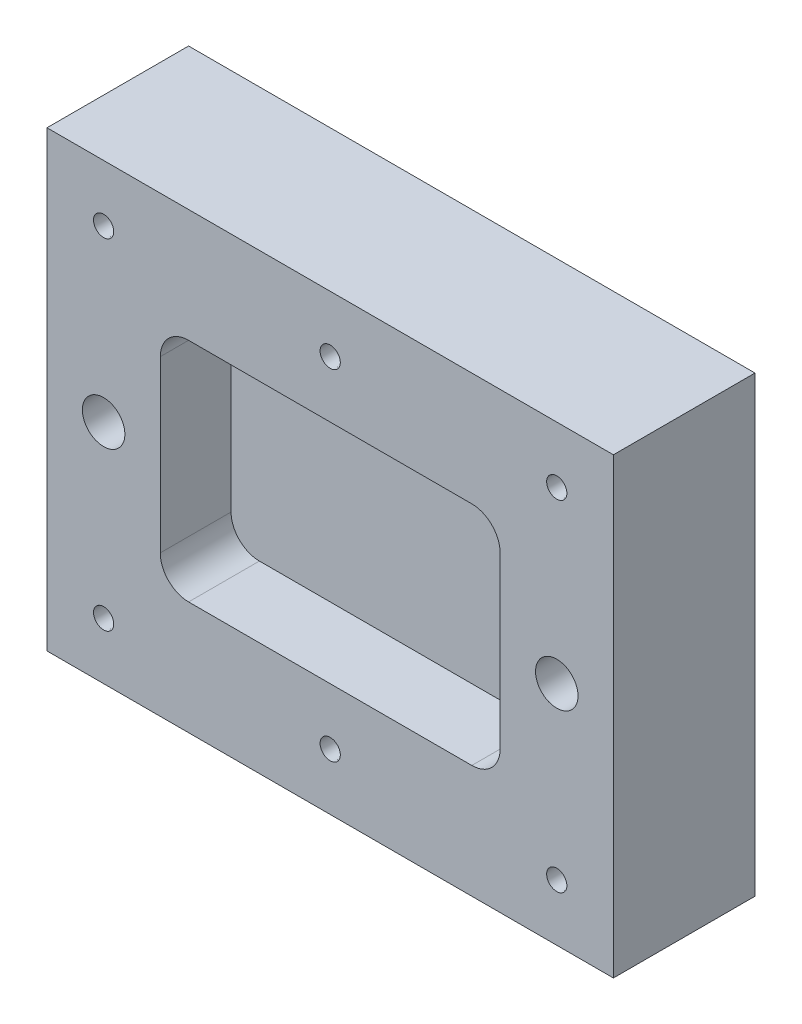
from build123d import *

# Parameters (mm, degrees)
SKETCH1_W                          = 200
SKETCH1_H                          = 160
BASE_EXTRUDE_DEPTH                 = 50
CUT_EXTRUDE1_DEPTH                 = 25
F_1_16_NPT_TAPPED_HOLE1_AT_2_COUNT = 2
F_1_16_NPT_TAPPED_HOLE1_AT_2_PITCH = 160
F_1_16_NPT_TAPPED_HOLE1_AT_3_COUNT = 2
F_1_16_NPT_TAPPED_HOLE1_AT_3_PITCH = 200
F_1_16_NPT_TAPPED_HOLE1_AT_4_COUNT = 2
F_1_16_NPT_TAPPED_HOLE1_AT_4_PITCH = 120
F_1_16_NPT_TAPPED_HOLE1_AT_5_COUNT = 2
F_1_16_NPT_TAPPED_HOLE1_AT_5_PITCH = 144.222051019
F_1_16_NPT_TAPPED_HOLE1_AT_6_COUNT = 2
F_1_16_NPT_TAPPED_HOLE1_AT_6_PITCH = 80
SKETCH8_R                          = 7.5
CUT_EXTRUDE2_DEPTH                 = 138.477270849


with BuildPart() as part:
    # Sketch1 → Base-Extrude (new body)
    with BuildSketch(Plane.XY):
        Rectangle(SKETCH1_W, SKETCH1_H)
    extrude(amount=-BASE_EXTRUDE_DEPTH)

    # Sketch2 → Cut-Extrude1 (cut)
    with BuildSketch(Plane.XY):
        with BuildLine():
            Line((-50, 40), (50, 40))
            ThreePointArc((50, 40), (57.071067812, 37.071067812), (60, 30))
            Line((60, 30), (60, -30))
            ThreePointArc((60, -30), (57.071067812, -37.071067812), (50, -40))
            Line((50, -40), (-50, -40))
            ThreePointArc((-50, -40), (-57.071067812, -37.071067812), (-60, -30))
            Line((-60, -30), (-60, 30))
            ThreePointArc((-60, 30), (-57.071067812, 37.071067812), (-50, 40))
        make_face()
    extrude(amount=-CUT_EXTRUDE1_DEPTH, mode=Mode.SUBTRACT)

    # Sketch7 → 1_16 NPT Tapped Hole1 (revolve, cut)
    with BuildSketch(Plane(origin=(-80, 60, 0), x_dir=(0, -1, 0), z_dir=(1, 0, 0))):
        Polygon((0, 0), (0, 50), (3.0734, 50), (3.0734, 6.89), (3.356012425, 6.89), (3.571113, 0), align=None)
    f_1_16_npt_tapped_hole1 = revolve(axis=Axis((-80, 60, 6.35), (0, 0, -1)), mode=Mode.SUBTRACT)

    # 1_16 NPT Tapped Hole1 at 2: 1_16 NPT Tapped Hole1 ×2
    with Locations(*[(i * F_1_16_NPT_TAPPED_HOLE1_AT_2_PITCH, 0, 0) for i in range(1, F_1_16_NPT_TAPPED_HOLE1_AT_2_COUNT)]):
        add(f_1_16_npt_tapped_hole1, mode=Mode.SUBTRACT)

    # 1_16 NPT Tapped Hole1 at 3: 1_16 NPT Tapped Hole1 ×2
    with Locations(*[Vector(0.8, -0.6000000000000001, 0) * (i * F_1_16_NPT_TAPPED_HOLE1_AT_3_PITCH) for i in range(1, F_1_16_NPT_TAPPED_HOLE1_AT_3_COUNT)]):
        add(f_1_16_npt_tapped_hole1, mode=Mode.SUBTRACT)

    # 1_16 NPT Tapped Hole1 at 4: 1_16 NPT Tapped Hole1 ×2
    with Locations(*[(0, -i * F_1_16_NPT_TAPPED_HOLE1_AT_4_PITCH, 0) for i in range(1, F_1_16_NPT_TAPPED_HOLE1_AT_4_COUNT)]):
        add(f_1_16_npt_tapped_hole1, mode=Mode.SUBTRACT)

    # 1_16 NPT Tapped Hole1 at 5: 1_16 NPT Tapped Hole1 ×2
    with Locations(*[Vector(0.5547001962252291, -0.8320502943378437, 0) * (i * F_1_16_NPT_TAPPED_HOLE1_AT_5_PITCH) for i in range(1, F_1_16_NPT_TAPPED_HOLE1_AT_5_COUNT)]):
        add(f_1_16_npt_tapped_hole1, mode=Mode.SUBTRACT)

    # 1_16 NPT Tapped Hole1 at 6: 1_16 NPT Tapped Hole1 ×2
    with Locations(*[(i * F_1_16_NPT_TAPPED_HOLE1_AT_6_PITCH, 0, 0) for i in range(1, F_1_16_NPT_TAPPED_HOLE1_AT_6_COUNT)]):
        add(f_1_16_npt_tapped_hole1, mode=Mode.SUBTRACT)

    # Sketch8 → Cut-Extrude2 (cut, through all)
    with BuildSketch(Plane.XY):
        with Locations((-80, 0)):
            Circle(SKETCH8_R)
        with Locations((80, 0)):
            Circle(SKETCH8_R)
    extrude(amount=-CUT_EXTRUDE2_DEPTH, mode=Mode.SUBTRACT)


solid = part.part
